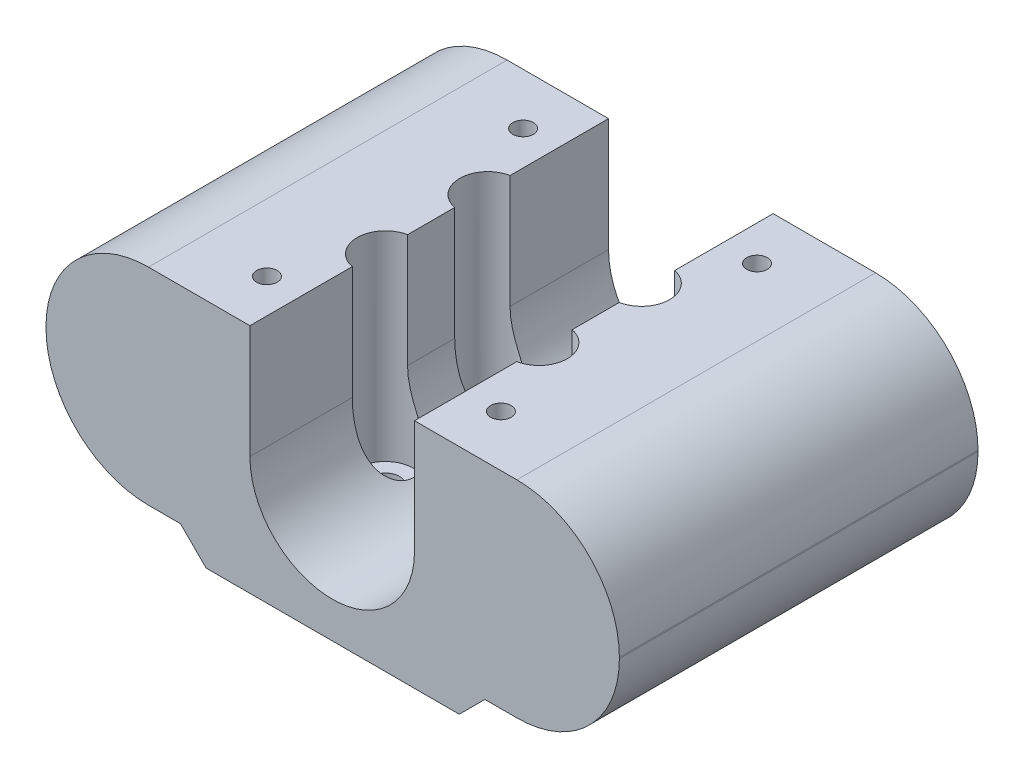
from build123d import *

# Parameters (mm, degrees)
SKETCH1_W                     = 20
SKETCH1_H                     = 28
BOSS_EXTRUDE1_DEPTH           = 18.1
SKETCH3_R                     = 6.425
CUT_EXTRUDE1_DEPTH            = 35.942397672
CBORE_FOR_M2_SHCS3_AT_2_COUNT = 2
CBORE_FOR_M2_SHCS3_AT_2_PITCH = 12
CBORE_FOR_M2_SHCS3_AT_3_COUNT = 2
CBORE_FOR_M2_SHCS3_AT_3_PITCH = 14.422205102
CBORE_FOR_M2_SHCS3_AT_4_COUNT = 2
CBORE_FOR_M2_SHCS3_AT_4_PITCH = 8
SKETCH21_W                    = 1.919776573
SKETCH21_H                    = 28
SKETCH21_W_2                  = 1.844738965
BOSS_EXTRUDE2_DEPTH           = 18.1
M2X0_4_TAPPED_HOLE1_D         = 1.6
M2X0_4_TAPPED_HOLE1_DEPTH     = 3.1
M2X0_4_TAPPED_HOLE1_TIP       = 0.480688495
CHAMFER2_SIZE                 = 2
SKETCH26_W                    = 28
SKETCH26_H                    = 16.1
BOSS_EXTRUDE3_DEPTH           = 10.5
SKETCH28_R                    = 4.25
CUT_EXTRUDE2_DEPTH            = 19
SKETCH29_W                    = 28
SKETCH29_H                    = 16.1
BOSS_EXTRUDE4_DEPTH           = 10.5
SKETCH30_R                    = 4.25
CUT_EXTRUDE3_DEPTH            = 19
FILLET1_R                     = 8


with BuildPart() as part:
    # Sketch1 → Boss-Extrude1 (new body)
    with BuildSketch(Plane(origin=(0, 0, 0), x_dir=(1, 0, 0), z_dir=(0, 1, 0))):
        with Locations((-0.457588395, -1.357874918)):
            Rectangle(SKETCH1_W, SKETCH1_H)
    extrude(amount=BOSS_EXTRUDE1_DEPTH)

    # Sketch3 → Cut-Extrude1 (cut, through all)
    with BuildSketch(Plane.XY.offset(15.357874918)):
        with BuildLine():
            Line((-6.882588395, 18.1), (-6.882588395, 9.25))
            ThreePointArc((-6.882588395, 9.25), (-0.457588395, 15.675), (5.967411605, 9.25))
            Line((5.967411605, 9.25), (5.967411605, 18.1))
            Line((5.967411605, 18.1), (-6.882588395, 18.1))
        make_face()
        with Locations((-0.457588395, 9.25)):
            Circle(SKETCH3_R)
    extrude(amount=-CUT_EXTRUDE1_DEPTH, mode=Mode.SUBTRACT)

    # Sketch20 → CBORE for M2 SHCS3 (revolve, cut)
    with BuildSketch(Plane(origin=(-6.457588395, 18.1, 5.207874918), x_dir=(0, 0, 1), z_dir=(1, 0, 0))):
        Polygon((0, 0), (0, 18.1), (1.225, 18.1), (1.1, 17.975), (1.1, 15.6), (2.2, 15.6), (2.2, 0), align=None)
    cbore_for_m2_shcs3 = revolve(axis=Axis((-6.457588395, 24.45, 5.207874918), (0, -1, 0)), mode=Mode.SUBTRACT)

    # CBORE for M2 SHCS3 at 2: CBORE for M2 SHCS3 ×2
    with Locations(*[(i * CBORE_FOR_M2_SHCS3_AT_2_PITCH, 0, 0) for i in range(1, CBORE_FOR_M2_SHCS3_AT_2_COUNT)]):
        add(cbore_for_m2_shcs3, mode=Mode.SUBTRACT)

    # CBORE for M2 SHCS3 at 3: CBORE for M2 SHCS3 ×2
    with Locations(*[Vector(0.8320502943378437, 0, -0.554700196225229) * (i * CBORE_FOR_M2_SHCS3_AT_3_PITCH) for i in range(1, CBORE_FOR_M2_SHCS3_AT_3_COUNT)]):
        add(cbore_for_m2_shcs3, mode=Mode.SUBTRACT)

    # CBORE for M2 SHCS3 at 4: CBORE for M2 SHCS3 ×2
    with Locations(*[(0, 0, -i * CBORE_FOR_M2_SHCS3_AT_4_PITCH) for i in range(1, CBORE_FOR_M2_SHCS3_AT_4_COUNT)]):
        add(cbore_for_m2_shcs3, mode=Mode.SUBTRACT)

    # Sketch21 → Boss-Extrude2 (add)
    with BuildSketch(Plane(origin=(0, 18.1, 0), x_dir=(1, 0, 0), z_dir=(0, 1, 0))):
        with Locations((10.502299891, -1.357874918)):
            Rectangle(SKETCH21_W, SKETCH21_H)
        with Locations((-11.379957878, -1.357874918)):
            Rectangle(SKETCH21_W_2, SKETCH21_H)
    extrude(amount=-BOSS_EXTRUDE2_DEPTH)

    # M2x0.4 Tapped Hole1
    with Locations(Plane(origin=(0, 18.1, 0), x_dir=(1, 0, 0), z_dir=(0, 1, 0))):
        with Locations((8.712188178, 8.642125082), (8.712188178, -11.357874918), (-9.55232736, -11.357874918), (-9.55232736, 8.642125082)):
            Hole(M2X0_4_TAPPED_HOLE1_D / 2, depth=M2X0_4_TAPPED_HOLE1_DEPTH)
            with Locations((0, 0, -(M2X0_4_TAPPED_HOLE1_DEPTH + M2X0_4_TAPPED_HOLE1_TIP / 2))):  # 118° drill point
                Cone(0, M2X0_4_TAPPED_HOLE1_D / 2, M2X0_4_TAPPED_HOLE1_TIP, mode=Mode.SUBTRACT)

    # Chamfer2
    chamfer2_edges = [part.edges().sort_by_distance(p)[0] for p in [
        (-12.30232736, 0, 1.357874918),
        (11.462188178, 0, 1.357874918),
    ]]
    chamfer(chamfer2_edges, length=CHAMFER2_SIZE)

    # Sketch26 → Boss-Extrude3 (add)
    with BuildSketch(Plane.ZY.offset(12.30232736)):
        with Locations((1.357874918, 10.05)):
            Rectangle(SKETCH26_W, SKETCH26_H)
    extrude(amount=BOSS_EXTRUDE3_DEPTH)

    # Sketch28 → Cut-Extrude2 (cut)
    with BuildSketch(Plane(origin=(0, 0, -12.642125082), x_dir=(-1, 0, 0), z_dir=(0, 0, -1))):
        with Locations((16.882588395, 9.25)):
            Circle(SKETCH28_R)
    extrude(amount=-CUT_EXTRUDE2_DEPTH, mode=Mode.SUBTRACT)

    # Sketch29 → Boss-Extrude4 (add)
    with BuildSketch(Plane(origin=(11.462188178, 0, 0), x_dir=(0, 0, -1), z_dir=(1, 0, 0))):
        with Locations((-1.357874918, 10.05)):
            Rectangle(SKETCH29_W, SKETCH29_H)
    extrude(amount=BOSS_EXTRUDE4_DEPTH)

    # Sketch30 → Cut-Extrude3 (cut)
    with BuildSketch(Plane(origin=(0, 0, -12.642125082), x_dir=(-1, 0, 0), z_dir=(0, 0, -1))):
        with Locations((-15.967411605, 9.25)):
            Circle(SKETCH30_R)
    extrude(amount=-CUT_EXTRUDE3_DEPTH, mode=Mode.SUBTRACT)

    # Fillet1
    fillet1_edges = [part.edges().sort_by_distance(p)[0] for p in [
        (-22.80232736, 2, 1.357874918),
        (-22.80232736, 18.1, 1.357874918),
        (21.962188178, 18.1, 1.357874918),
        (21.962188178, 2, 1.357874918),
    ]]
    fillet(fillet1_edges, radius=FILLET1_R)


solid = part.part
